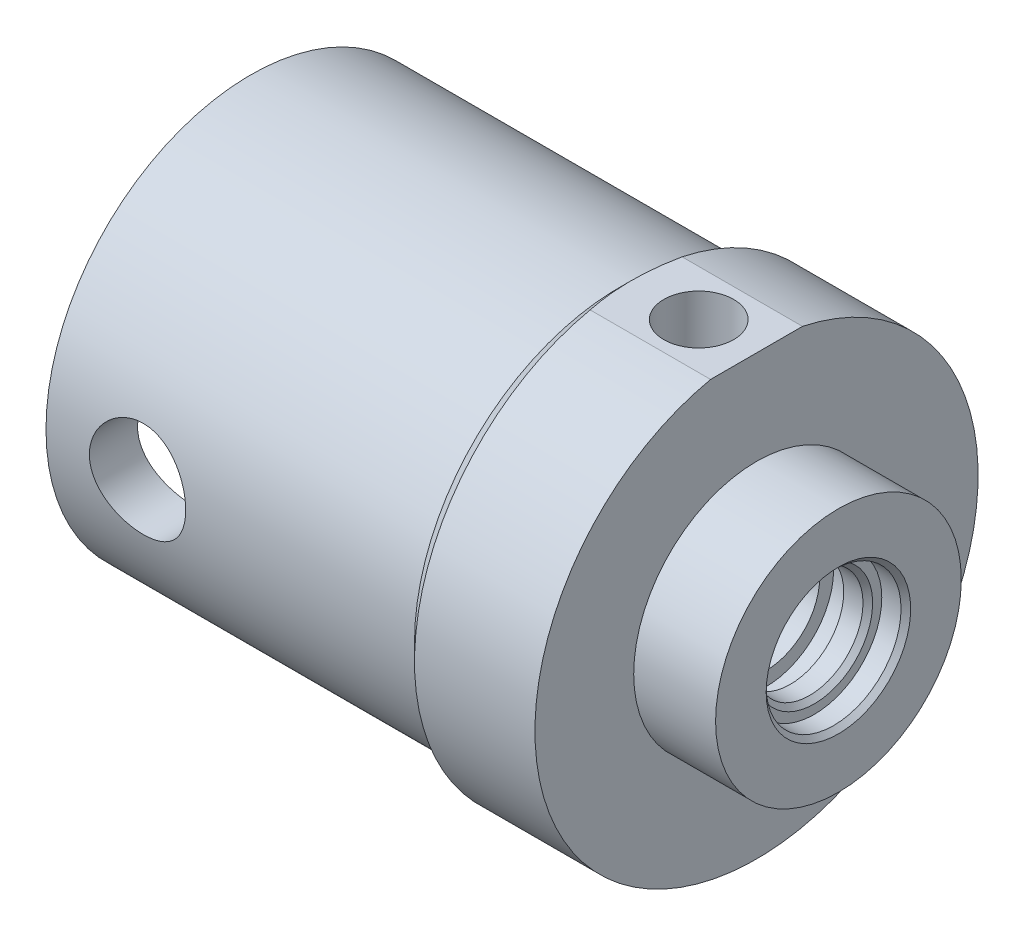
from build123d import *

# Parameters (mm, degrees)
CHANFREIN1_SIZE              = 1
ESQUISSE4_W                  = 132.217663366
ESQUISSE4_H                  = 30.780831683
ENL_V_MAT_EXTRU_1_DEPTH      = 124.519229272
TROU_TARAUD_G3_8_D           = 14.5
TROU_TARAUD_G3_8_DEPTH       = 22.5
TROU_TARAUD_G3_8_TIP         = 4.356239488
ENL_V_MAT_EXTRU_2_DEPTH      = 139.260623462
ENL_V_MAT_EXTRU_2_DEPTH_BACK = 139.260623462
ESQUISSE7_R                  = 10


with BuildPart() as part:
    # Esquisse1 → R_volution1 (revolve)
    with BuildSketch(Plane.XY, mode=Mode.PRIVATE) as r_volution1_sk:
        Polygon((0, 0), (0, 42.5), (76.5, 42.5), (80, 46), (105, 46), (105, 25.5), (122, 25.5), (122, 0), align=None)
    revolve(r_volution1_sk.sketch.rotate(Axis((0, 0, 0), (1, 0, 0)), 90), axis=Axis((0, 0, 0), (1, 0, 0)))

    # Esquisse2 → Enl_vement de mati_re-R_volution1 (revolve, cut)
    with BuildSketch(Plane.XY, mode=Mode.PRIVATE) as enl_vement_de_mati_re_r_volution1_sk:
        Polygon((0, 0), (0, 36), (3, 36), (3, 37.5), (7, 37.5), (7, 32.5), (30.252522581, 32.5), (33, 31.5), (88, 31.5), (88, 11.1), (92.4, 11.1), (92.4, 14), (102, 14), (102, 11.1), (107, 11.1), (107, 14), (112, 14), (112, 11.1), (117, 11.1), (117, 14), (122, 14), (122, 0), align=None)
    revolve(enl_vement_de_mati_re_r_volution1_sk.sketch.rotate(Axis((122, 0, 0), (-1, 0, 0)), 90), axis=Axis((122, 0, 0), (-1, 0, 0)), mode=Mode.SUBTRACT)

    # Chanfrein1
    chanfrein1_edges = [part.edges().sort_by_distance(p)[0] for p in [
        (117, 0, 11.1),
        (122, 0, 14),
    ]]
    chamfer(chanfrein1_edges, length=CHANFREIN1_SIZE)

    # Esquisse4 → Enl_v. mat.-Extru.1 (cut, through all)
    with BuildSketch(Plane(origin=(105, 0, 0), x_dir=(0, 0, -1), z_dir=(1, 0, 0))):
        with Locations((6.121188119, 60.390415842)):
            Rectangle(ESQUISSE4_W, ESQUISSE4_H)
    extrude(amount=-ENL_V_MAT_EXTRU_1_DEPTH, mode=Mode.SUBTRACT)

    # Trou taraud_ G3_8
    with Locations(Plane(origin=(0, 45, 0), x_dir=(-1, 0, 0), z_dir=(0, 1, 0))):
        with Locations((-93, 0)):
            Hole(TROU_TARAUD_G3_8_D / 2, depth=TROU_TARAUD_G3_8_DEPTH)
            with Locations((0, 0, -(TROU_TARAUD_G3_8_DEPTH + TROU_TARAUD_G3_8_TIP / 2))):  # 118° drill point
                Cone(0, TROU_TARAUD_G3_8_D / 2, TROU_TARAUD_G3_8_TIP, mode=Mode.SUBTRACT)

    # Esquisse7 → Enl_v. mat.-Extru.2 (cut, two sides: drawn at the far end of the back side and taken through both)
    with BuildSketch(Plane.XY.offset(-ENL_V_MAT_EXTRU_2_DEPTH_BACK)):
        with Locations((19, 0)):
            Circle(ESQUISSE7_R)
    extrude(amount=ENL_V_MAT_EXTRU_2_DEPTH + ENL_V_MAT_EXTRU_2_DEPTH_BACK, mode=Mode.SUBTRACT)


solid = part.part
